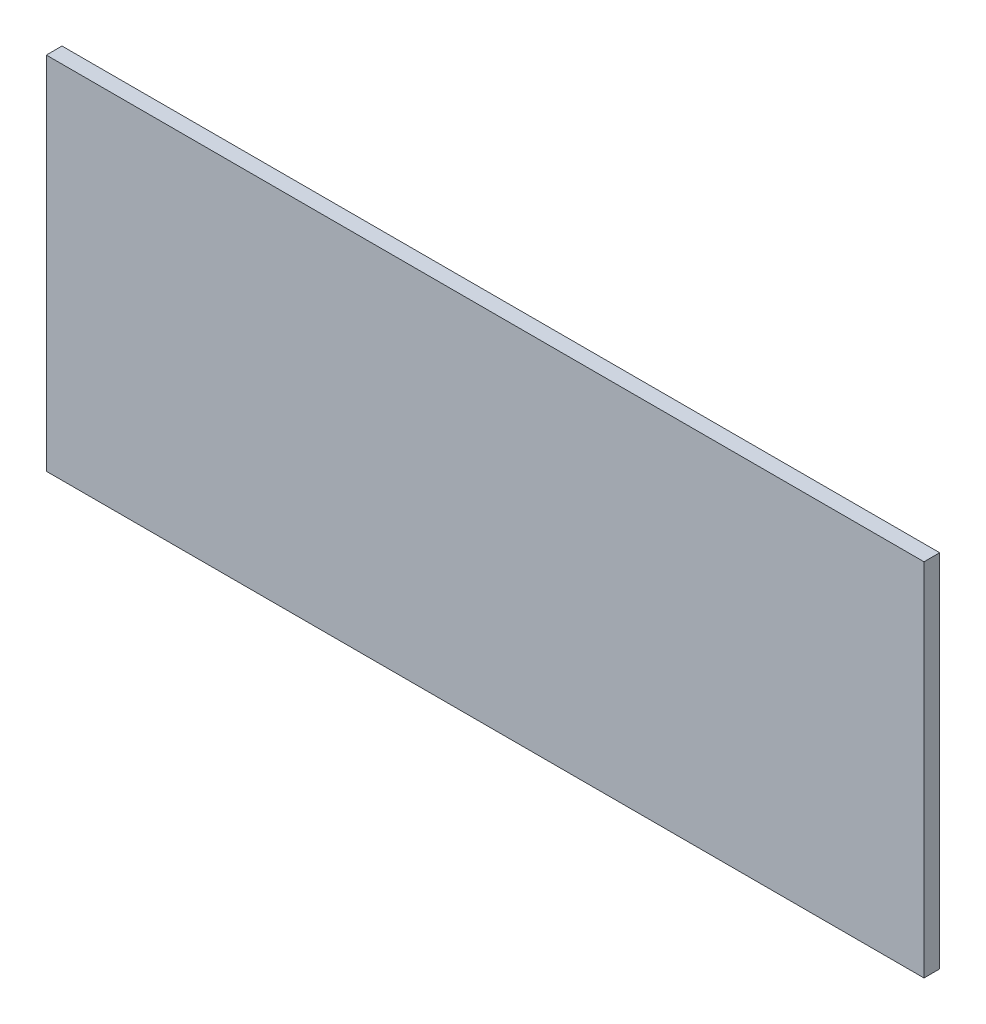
ISO-10303-21;
HEADER;
FILE_DESCRIPTION(('STEP AP214'),'2;1');
FILE_NAME('part.step','',(''),(''),'','','');
FILE_SCHEMA(('AUTOMOTIVE_DESIGN { 1 0 10303 214 1 1 1 1 }'));
ENDSEC;
DATA;
#1=APPLICATION_CONTEXT('core data for automotive mechanical design processes');
#2=APPLICATION_PROTOCOL_DEFINITION('international standard','automotive_design',2000,#1);
#3=PRODUCT_CONTEXT('',#1,'mechanical');
#4=PRODUCT('Part','Part','',(#3));
#5=PRODUCT_RELATED_PRODUCT_CATEGORY('part','',(#4));
#6=PRODUCT_DEFINITION_FORMATION('','',#4);
#7=PRODUCT_DEFINITION_CONTEXT('part definition',#1,'design');
#8=PRODUCT_DEFINITION('design','',#6,#7);
#9=PRODUCT_DEFINITION_SHAPE('','',#8);
#10=(LENGTH_UNIT() NAMED_UNIT(*) SI_UNIT(.MILLI.,.METRE.));
#11=(NAMED_UNIT(*) PLANE_ANGLE_UNIT() SI_UNIT($,.RADIAN.));
#12=(NAMED_UNIT(*) SI_UNIT($,.STERADIAN.) SOLID_ANGLE_UNIT());
#13=UNCERTAINTY_MEASURE_WITH_UNIT(LENGTH_MEASURE(1.E-05),#10,'distance_accuracy_value','');
#14=(GEOMETRIC_REPRESENTATION_CONTEXT(3) GLOBAL_UNCERTAINTY_ASSIGNED_CONTEXT((#13)) GLOBAL_UNIT_ASSIGNED_CONTEXT((#10,
#11,#12)) REPRESENTATION_CONTEXT('',''));
#15=CARTESIAN_POINT('',(0.,0.,0.));
#16=DIRECTION('',(0.,0.,1.));
#17=DIRECTION('',(1.,0.,0.));
#18=AXIS2_PLACEMENT_3D('',#15,#16,#17);
#19=CARTESIAN_POINT('',(0.,0.,19.05));
#20=DIRECTION('',(1.,0.,0.));
#21=DIRECTION('',(0.,0.,-1.));
#22=AXIS2_PLACEMENT_3D('',#19,#20,#21);
#23=PLANE('',#22);
#24=DIRECTION('',(0.,-1.,0.));
#25=VECTOR('',#24,1.);
#26=CARTESIAN_POINT('',(0.,0.,0.));
#27=LINE('',#26,#25);
#28=CARTESIAN_POINT('',(0.,438.15,0.));
#29=VERTEX_POINT('',#28);
#30=CARTESIAN_POINT('',(0.,0.,0.));
#31=VERTEX_POINT('',#30);
#32=EDGE_CURVE('E70',#29,#31,#27,.T.);
#33=ORIENTED_EDGE('',*,*,#32,.T.);
#34=DIRECTION('',(0.,0.,-1.));
#35=VECTOR('',#34,1.);
#36=CARTESIAN_POINT('',(0.,0.,19.05));
#37=LINE('',#36,#35);
#38=CARTESIAN_POINT('',(0.,0.,19.05));
#39=VERTEX_POINT('',#38);
#40=EDGE_CURVE('E11',#39,#31,#37,.T.);
#41=ORIENTED_EDGE('',*,*,#40,.F.);
#42=DIRECTION('',(0.,-1.,0.));
#43=VECTOR('',#42,1.);
#44=CARTESIAN_POINT('',(0.,0.,19.05));
#45=LINE('',#44,#43);
#46=CARTESIAN_POINT('',(0.,438.15,19.05));
#47=VERTEX_POINT('',#46);
#48=EDGE_CURVE('E88',#47,#39,#45,.T.);
#49=ORIENTED_EDGE('',*,*,#48,.F.);
#50=DIRECTION('',(0.,0.,-1.));
#51=VECTOR('',#50,1.);
#52=CARTESIAN_POINT('',(0.,438.15,19.05));
#53=LINE('',#52,#51);
#54=EDGE_CURVE('E82',#47,#29,#53,.T.);
#55=ORIENTED_EDGE('',*,*,#54,.T.);
#56=EDGE_LOOP('',(#33,#41,#49,#55));
#57=FACE_BOUND('',#56,.T.);
#58=ADVANCED_FACE('F26',(#57),#23,.F.);
#59=CARTESIAN_POINT('',(0.,0.,19.05));
#60=DIRECTION('',(0.,1.,0.));
#61=DIRECTION('',(0.,0.,1.));
#62=AXIS2_PLACEMENT_3D('',#59,#60,#61);
#63=PLANE('',#62);
#64=DIRECTION('',(1.,0.,0.));
#65=VECTOR('',#64,1.);
#66=CARTESIAN_POINT('',(0.,0.,0.));
#67=LINE('',#66,#65);
#68=CARTESIAN_POINT('',(1066.8,0.,0.));
#69=VERTEX_POINT('',#68);
#70=EDGE_CURVE('E66',#31,#69,#67,.T.);
#71=ORIENTED_EDGE('',*,*,#70,.T.);
#72=DIRECTION('',(0.,0.,-1.));
#73=VECTOR('',#72,1.);
#74=CARTESIAN_POINT('',(1066.8,0.,19.05));
#75=LINE('',#74,#73);
#76=CARTESIAN_POINT('',(1066.8,0.,19.05));
#77=VERTEX_POINT('',#76);
#78=EDGE_CURVE('E33',#77,#69,#75,.T.);
#79=ORIENTED_EDGE('',*,*,#78,.F.);
#80=DIRECTION('',(1.,0.,0.));
#81=VECTOR('',#80,1.);
#82=CARTESIAN_POINT('',(0.,0.,19.05));
#83=LINE('',#82,#81);
#84=EDGE_CURVE('E78',#39,#77,#83,.T.);
#85=ORIENTED_EDGE('',*,*,#84,.F.);
#86=ORIENTED_EDGE('',*,*,#40,.T.);
#87=EDGE_LOOP('',(#71,#79,#85,#86));
#88=FACE_BOUND('',#87,.T.);
#89=ADVANCED_FACE('F77',(#88),#63,.F.);
#90=CARTESIAN_POINT('',(1066.8,0.,19.05));
#91=DIRECTION('',(-1.,0.,0.));
#92=DIRECTION('',(0.,0.,1.));
#93=AXIS2_PLACEMENT_3D('',#90,#91,#92);
#94=PLANE('',#93);
#95=DIRECTION('',(0.,1.,0.));
#96=VECTOR('',#95,1.);
#97=CARTESIAN_POINT('',(1066.8,0.,0.));
#98=LINE('',#97,#96);
#99=CARTESIAN_POINT('',(1066.8,438.15,0.));
#100=VERTEX_POINT('',#99);
#101=EDGE_CURVE('E71',#69,#100,#98,.T.);
#102=ORIENTED_EDGE('',*,*,#101,.T.);
#103=DIRECTION('',(0.,0.,-1.));
#104=VECTOR('',#103,1.);
#105=CARTESIAN_POINT('',(1066.8,438.15,19.05));
#106=LINE('',#105,#104);
#107=CARTESIAN_POINT('',(1066.8,438.15,19.05));
#108=VERTEX_POINT('',#107);
#109=EDGE_CURVE('E94',#108,#100,#106,.T.);
#110=ORIENTED_EDGE('',*,*,#109,.F.);
#111=DIRECTION('',(0.,1.,0.));
#112=VECTOR('',#111,1.);
#113=CARTESIAN_POINT('',(1066.8,0.,19.05));
#114=LINE('',#113,#112);
#115=EDGE_CURVE('E45',#77,#108,#114,.T.);
#116=ORIENTED_EDGE('',*,*,#115,.F.);
#117=ORIENTED_EDGE('',*,*,#78,.T.);
#118=EDGE_LOOP('',(#102,#110,#116,#117));
#119=FACE_BOUND('',#118,.T.);
#120=ADVANCED_FACE('F97',(#119),#94,.F.);
#121=CARTESIAN_POINT('',(0.,438.15,19.05));
#122=DIRECTION('',(0.,-1.,0.));
#123=DIRECTION('',(0.,0.,-1.));
#124=AXIS2_PLACEMENT_3D('',#121,#122,#123);
#125=PLANE('',#124);
#126=DIRECTION('',(-1.,0.,0.));
#127=VECTOR('',#126,1.);
#128=CARTESIAN_POINT('',(0.,438.15,0.));
#129=LINE('',#128,#127);
#130=EDGE_CURVE('E86',#100,#29,#129,.T.);
#131=ORIENTED_EDGE('',*,*,#130,.T.);
#132=ORIENTED_EDGE('',*,*,#54,.F.);
#133=DIRECTION('',(-1.,0.,0.));
#134=VECTOR('',#133,1.);
#135=CARTESIAN_POINT('',(0.,438.15,19.05));
#136=LINE('',#135,#134);
#137=EDGE_CURVE('E40',#108,#47,#136,.T.);
#138=ORIENTED_EDGE('',*,*,#137,.F.);
#139=ORIENTED_EDGE('',*,*,#109,.T.);
#140=EDGE_LOOP('',(#131,#132,#138,#139));
#141=FACE_BOUND('',#140,.T.);
#142=ADVANCED_FACE('F99',(#141),#125,.F.);
#143=CARTESIAN_POINT('',(0.,438.15,19.05));
#144=DIRECTION('',(0.,0.,-1.));
#145=DIRECTION('',(-1.,0.,0.));
#146=AXIS2_PLACEMENT_3D('',#143,#144,#145);
#147=PLANE('',#146);
#148=ORIENTED_EDGE('',*,*,#48,.T.);
#149=ORIENTED_EDGE('',*,*,#84,.T.);
#150=ORIENTED_EDGE('',*,*,#115,.T.);
#151=ORIENTED_EDGE('',*,*,#137,.T.);
#152=EDGE_LOOP('',(#148,#149,#150,#151));
#153=FACE_BOUND('',#152,.T.);
#154=ADVANCED_FACE('F100',(#153),#147,.F.);
#155=CARTESIAN_POINT('',(0.,438.15,0.));
#156=DIRECTION('',(0.,0.,-1.));
#157=DIRECTION('',(-1.,0.,0.));
#158=AXIS2_PLACEMENT_3D('',#155,#156,#157);
#159=PLANE('',#158);
#160=ORIENTED_EDGE('',*,*,#32,.F.);
#161=ORIENTED_EDGE('',*,*,#130,.F.);
#162=ORIENTED_EDGE('',*,*,#101,.F.);
#163=ORIENTED_EDGE('',*,*,#70,.F.);
#164=EDGE_LOOP('',(#160,#161,#162,#163));
#165=FACE_BOUND('',#164,.T.);
#166=ADVANCED_FACE('F67',(#165),#159,.T.);
#167=CLOSED_SHELL('',(#58,#89,#120,#142,#154,#166));
#168=MANIFOLD_SOLID_BREP('B2',#167);
#169=ADVANCED_BREP_SHAPE_REPRESENTATION('',(#18,#168),#14);
#170=SHAPE_DEFINITION_REPRESENTATION(#9,#169);
ENDSEC;
END-ISO-10303-21;
